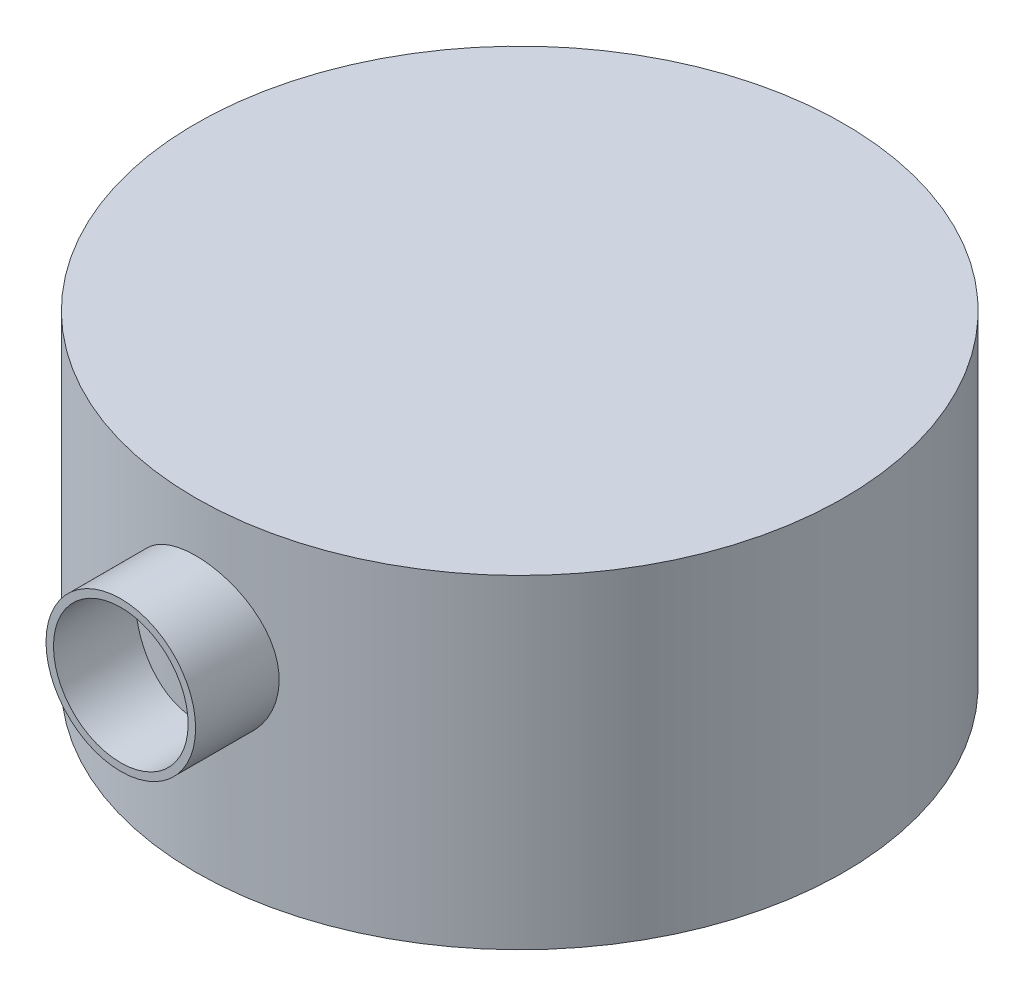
ISO-10303-21;
HEADER;
FILE_DESCRIPTION(('STEP AP214'),'2;1');
FILE_NAME('part.step','',(''),(''),'','','');
FILE_SCHEMA(('AUTOMOTIVE_DESIGN { 1 0 10303 214 1 1 1 1 }'));
ENDSEC;
DATA;
#1=APPLICATION_CONTEXT('core data for automotive mechanical design processes');
#2=APPLICATION_PROTOCOL_DEFINITION('international standard','automotive_design',2000,#1);
#3=PRODUCT_CONTEXT('',#1,'mechanical');
#4=PRODUCT('Part','Part','',(#3));
#5=PRODUCT_RELATED_PRODUCT_CATEGORY('part','',(#4));
#6=PRODUCT_DEFINITION_FORMATION('','',#4);
#7=PRODUCT_DEFINITION_CONTEXT('part definition',#1,'design');
#8=PRODUCT_DEFINITION('design','',#6,#7);
#9=PRODUCT_DEFINITION_SHAPE('','',#8);
#10=(LENGTH_UNIT() NAMED_UNIT(*) SI_UNIT(.MILLI.,.METRE.));
#11=(NAMED_UNIT(*) PLANE_ANGLE_UNIT() SI_UNIT($,.RADIAN.));
#12=(NAMED_UNIT(*) SI_UNIT($,.STERADIAN.) SOLID_ANGLE_UNIT());
#13=UNCERTAINTY_MEASURE_WITH_UNIT(LENGTH_MEASURE(1.E-05),#10,'distance_accuracy_value','');
#14=(GEOMETRIC_REPRESENTATION_CONTEXT(3) GLOBAL_UNCERTAINTY_ASSIGNED_CONTEXT((#13)) GLOBAL_UNIT_ASSIGNED_CONTEXT((#10,
#11,#12)) REPRESENTATION_CONTEXT('',''));
#15=CARTESIAN_POINT('',(0.,0.,0.));
#16=DIRECTION('',(0.,0.,1.));
#17=DIRECTION('',(1.,0.,0.));
#18=AXIS2_PLACEMENT_3D('',#15,#16,#17);
#19=CARTESIAN_POINT('',(0.,65.,0.));
#20=DIRECTION('',(0.,-1.,0.));
#21=DIRECTION('',(0.,0.,-1.));
#22=AXIS2_PLACEMENT_3D('',#19,#20,#21);
#23=CYLINDRICAL_SURFACE('',#22,65.);
#24=CARTESIAN_POINT('',(0.,65.,0.));
#25=DIRECTION('',(0.,1.,0.));
#26=DIRECTION('',(0.,0.,1.));
#27=AXIS2_PLACEMENT_3D('',#24,#25,#26);
#28=CIRCLE('',#27,65.);
#29=CARTESIAN_POINT('',(0.,65.,65.));
#30=VERTEX_POINT('',#29);
#31=EDGE_CURVE('E39',#30,#30,#28,.T.);
#32=ORIENTED_EDGE('',*,*,#31,.F.);
#33=EDGE_LOOP('',(#32));
#34=FACE_BOUND('',#33,.T.);
#35=CARTESIAN_POINT('',(0.,0.,0.));
#36=DIRECTION('',(0.,1.,0.));
#37=DIRECTION('',(0.,0.,1.));
#38=AXIS2_PLACEMENT_3D('',#35,#36,#37);
#39=CIRCLE('',#38,65.);
#40=CARTESIAN_POINT('',(0.,0.,65.));
#41=VERTEX_POINT('',#40);
#42=EDGE_CURVE('E43',#41,#41,#39,.T.);
#43=ORIENTED_EDGE('',*,*,#42,.T.);
#44=EDGE_LOOP('',(#43));
#45=FACE_BOUND('',#44,.T.);
#46=CARTESIAN_POINT('',(-15.,40.,63.2455532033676));
#47=CARTESIAN_POINT('',(-14.9999979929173,39.5847441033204,63.2455543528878));
#48=CARTESIAN_POINT('',(-14.9827415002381,39.169446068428,63.2496540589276));
#49=CARTESIAN_POINT('',(-14.9138518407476,38.3418380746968,63.2659327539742));
#50=CARTESIAN_POINT('',(-14.8622139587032,37.9295285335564,63.2781128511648));
#51=CARTESIAN_POINT('',(-14.724948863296,37.1106533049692,63.3101954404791));
#52=CARTESIAN_POINT('',(-14.6393011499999,36.704091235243,63.3301025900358));
#53=CARTESIAN_POINT('',(-14.4347188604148,35.8998719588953,63.3770454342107));
#54=CARTESIAN_POINT('',(-14.3157853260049,35.5022144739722,63.4040809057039));
#55=CARTESIAN_POINT('',(-14.0457301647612,34.7190105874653,63.4644512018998));
#56=CARTESIAN_POINT('',(-13.8946466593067,34.333450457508,63.497778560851));
#57=CARTESIAN_POINT('',(-13.5613532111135,33.5765507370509,63.5697942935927));
#58=CARTESIAN_POINT('',(-13.3791430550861,33.2052112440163,63.6084827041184));
#59=CARTESIAN_POINT('',(-12.9849272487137,32.4792099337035,63.6901260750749));
#60=CARTESIAN_POINT('',(-12.7729224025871,32.1245476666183,63.733080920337));
#61=CARTESIAN_POINT('',(-12.3205919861,31.4341769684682,63.8220661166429));
#62=CARTESIAN_POINT('',(-12.0802660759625,31.0984687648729,63.8680965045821));
#63=CARTESIAN_POINT('',(-11.5686191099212,30.4426505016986,63.9627692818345));
#64=CARTESIAN_POINT('',(-11.2968428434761,30.1228999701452,64.0114426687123));
#65=CARTESIAN_POINT('',(-10.7275109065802,29.5073223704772,64.1093122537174));
#66=CARTESIAN_POINT('',(-10.4299549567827,29.2114955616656,64.1585084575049));
#67=CARTESIAN_POINT('',(-9.81101299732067,28.6457129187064,64.25606710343));
#68=CARTESIAN_POINT('',(-9.48962506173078,28.3757591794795,64.3044294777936));
#69=CARTESIAN_POINT('',(-8.82515824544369,27.8635861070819,64.3989842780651));
#70=CARTESIAN_POINT('',(-8.4820792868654,27.6213668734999,64.4451766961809));
#71=CARTESIAN_POINT('',(-7.77233120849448,27.1636739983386,64.5346440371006));
#72=CARTESIAN_POINT('',(-7.40543141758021,26.9485498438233,64.577878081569));
#73=CARTESIAN_POINT('',(-6.6542672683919,26.5500374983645,64.659596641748));
#74=CARTESIAN_POINT('',(-6.27000273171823,26.3666496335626,64.698081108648));
#75=CARTESIAN_POINT('',(-5.48684724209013,26.0330518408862,64.7691984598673));
#76=CARTESIAN_POINT('',(-5.08795770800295,25.882838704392,64.8018319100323));
#77=CARTESIAN_POINT('',(-4.27839196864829,25.616784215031,64.860311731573));
#78=CARTESIAN_POINT('',(-3.86771599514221,25.5009421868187,64.8861582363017));
#79=CARTESIAN_POINT('',(-3.04481837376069,25.3063031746,64.9299305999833));
#80=CARTESIAN_POINT('',(-2.63274755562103,25.2268975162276,64.9479862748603));
#81=CARTESIAN_POINT('',(-1.80313867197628,25.1028663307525,64.9763105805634));
#82=CARTESIAN_POINT('',(-1.3856006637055,25.0582404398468,64.9865792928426));
#83=CARTESIAN_POINT('',(-0.548179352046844,25.0041495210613,64.9990371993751));
#84=CARTESIAN_POINT('',(-0.128296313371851,24.9946806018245,65.0012272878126));
#85=CARTESIAN_POINT('',(0.710746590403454,25.0109740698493,64.9974679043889));
#86=CARTESIAN_POINT('',(1.12990646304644,25.0367360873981,64.9915185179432));
#87=CARTESIAN_POINT('',(1.95648452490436,25.1224486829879,64.9718388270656));
#88=CARTESIAN_POINT('',(2.36397466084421,25.1817418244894,64.9582581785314));
#89=CARTESIAN_POINT('',(3.17239917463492,25.3335406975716,64.9237981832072));
#90=CARTESIAN_POINT('',(3.57333364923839,25.4260459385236,64.9029189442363));
#91=CARTESIAN_POINT('',(4.36588341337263,25.6435404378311,64.8544270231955));
#92=CARTESIAN_POINT('',(4.75749841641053,25.7685306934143,64.826814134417));
#93=CARTESIAN_POINT('',(5.52874476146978,26.0500356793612,64.765597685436));
#94=CARTESIAN_POINT('',(5.90837595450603,26.2065508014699,64.73199405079));
#95=CARTESIAN_POINT('',(6.65610440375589,26.5513155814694,64.6594038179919));
#96=CARTESIAN_POINT('',(7.02408572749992,26.7398080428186,64.6203764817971));
#97=CARTESIAN_POINT('',(7.74289461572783,27.1462820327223,64.5381938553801));
#98=CARTESIAN_POINT('',(8.0937221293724,27.3642636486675,64.4950385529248));
#99=CARTESIAN_POINT('',(8.77600332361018,27.8282301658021,64.4057464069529));
#100=CARTESIAN_POINT('',(9.10745456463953,28.0742185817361,64.3596091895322));
#101=CARTESIAN_POINT('',(9.74882371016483,28.592526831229,64.2655857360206));
#102=CARTESIAN_POINT('',(10.0587412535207,28.8648471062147,64.2176994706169));
#103=CARTESIAN_POINT('',(10.6619721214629,29.4406345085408,64.1203388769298));
#104=CARTESIAN_POINT('',(10.9547350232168,29.7446767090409,64.0708534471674));
#105=CARTESIAN_POINT('',(11.5136763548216,30.3764276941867,63.9727738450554));
#106=CARTESIAN_POINT('',(11.7798543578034,30.7041368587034,63.9241796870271));
#107=CARTESIAN_POINT('',(12.2838005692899,31.3810505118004,63.8292567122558));
#108=CARTESIAN_POINT('',(12.521567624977,31.7302558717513,63.7829279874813));
#109=CARTESIAN_POINT('',(12.9669869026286,32.447810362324,63.6938682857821));
#110=CARTESIAN_POINT('',(13.174639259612,32.8161594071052,63.6511372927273));
#111=CARTESIAN_POINT('',(13.5589932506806,33.5708726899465,63.5703738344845));
#112=CARTESIAN_POINT('',(13.7355795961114,33.9572975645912,63.5323590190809));
#113=CARTESIAN_POINT('',(14.0555000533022,34.7442117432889,63.4623491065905));
#114=CARTESIAN_POINT('',(14.1988339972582,35.1447011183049,63.4303540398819));
#115=CARTESIAN_POINT('',(14.4510673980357,35.9568074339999,63.3733649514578));
#116=CARTESIAN_POINT('',(14.5599718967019,36.3684227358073,63.3483699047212));
#117=CARTESIAN_POINT('',(14.7424555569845,37.1998010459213,63.306151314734));
#118=CARTESIAN_POINT('',(14.8160354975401,37.619563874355,63.2889276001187));
#119=CARTESIAN_POINT('',(14.9259758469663,38.4545153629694,63.2630884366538));
#120=CARTESIAN_POINT('',(14.9631411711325,38.869592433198,63.254286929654));
#121=CARTESIAN_POINT('',(15.0028094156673,39.7014899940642,63.2448901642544));
#122=CARTESIAN_POINT('',(15.0053128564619,40.1183104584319,63.2442947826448));
#123=CARTESIAN_POINT('',(14.9756377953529,40.9506133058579,63.2513280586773));
#124=CARTESIAN_POINT('',(14.9434617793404,41.3660957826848,63.2589561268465));
#125=CARTESIAN_POINT('',(14.8447038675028,42.1927224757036,63.2822039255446));
#126=CARTESIAN_POINT('',(14.7781220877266,42.6038667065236,63.2978236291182));
#127=CARTESIAN_POINT('',(14.6122354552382,43.4133514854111,63.3363221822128));
#128=CARTESIAN_POINT('',(14.513384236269,43.8117899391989,63.3591002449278));
#129=CARTESIAN_POINT('',(14.2835186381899,44.5988215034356,63.4113158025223));
#130=CARTESIAN_POINT('',(14.1525046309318,44.9874147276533,63.4407532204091));
#131=CARTESIAN_POINT('',(13.8592973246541,45.752182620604,63.5054517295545));
#132=CARTESIAN_POINT('',(13.6971015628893,46.1283563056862,63.5407132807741));
#133=CARTESIAN_POINT('',(13.3427204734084,46.8657971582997,63.6160719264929));
#134=CARTESIAN_POINT('',(13.1505346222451,47.2270640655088,63.6561691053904));
#135=CARTESIAN_POINT('',(12.734010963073,47.938368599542,63.7408101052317));
#136=CARTESIAN_POINT('',(12.5091826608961,48.2881114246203,63.7854178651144));
#137=CARTESIAN_POINT('',(12.0314669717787,48.967511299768,63.8772490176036));
#138=CARTESIAN_POINT('',(11.7785793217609,49.2971681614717,63.9244724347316));
#139=CARTESIAN_POINT('',(11.2464143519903,49.9343077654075,64.0202408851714));
#140=CARTESIAN_POINT('',(10.967133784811,50.241787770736,64.0687860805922));
#141=CARTESIAN_POINT('',(10.3840432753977,50.8325387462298,64.165870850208));
#142=CARTESIAN_POINT('',(10.0802331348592,51.1158095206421,64.2144104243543));
#143=CARTESIAN_POINT('',(9.44342756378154,51.6619592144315,64.3111773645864));
#144=CARTESIAN_POINT('',(9.10995328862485,51.9242851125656,64.3593767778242));
#145=CARTESIAN_POINT('',(8.42172481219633,52.4199187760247,64.453046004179));
#146=CARTESIAN_POINT('',(8.06697027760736,52.6532260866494,64.4985157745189));
#147=CARTESIAN_POINT('',(7.33860414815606,53.0891179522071,64.5854424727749));
#148=CARTESIAN_POINT('',(6.96499313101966,53.2917034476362,64.6268995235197));
#149=CARTESIAN_POINT('',(6.20148980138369,53.6646265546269,64.7046269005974));
#150=CARTESIAN_POINT('',(5.81159770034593,53.8349645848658,64.7408972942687));
#151=CARTESIAN_POINT('',(5.02099250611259,54.1410072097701,64.8069895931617));
#152=CARTESIAN_POINT('',(4.62037132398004,54.2769400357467,64.8368537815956));
#153=CARTESIAN_POINT('',(3.80864847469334,54.5145799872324,64.8895954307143));
#154=CARTESIAN_POINT('',(3.39754683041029,54.6162871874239,64.9124729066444));
#155=CARTESIAN_POINT('',(2.56792830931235,54.7846159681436,64.9505822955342));
#156=CARTESIAN_POINT('',(2.14941244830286,54.8512423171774,64.9658152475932));
#157=CARTESIAN_POINT('',(1.3080330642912,54.9488595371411,64.9881999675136));
#158=CARTESIAN_POINT('',(0.885169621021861,54.9798510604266,64.9953518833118));
#159=CARTESIAN_POINT('',(0.0480790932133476,55.0056311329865,65.0012986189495));
#160=CARTESIAN_POINT('',(-0.366121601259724,55.0012402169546,65.0002828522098));
#161=CARTESIAN_POINT('',(-1.19264255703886,54.9582366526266,64.9903716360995));
#162=CARTESIAN_POINT('',(-1.60496284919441,54.9196245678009,64.9814763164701));
#163=CARTESIAN_POINT('',(-2.42475582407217,54.8084996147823,64.956052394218));
#164=CARTESIAN_POINT('',(-2.83222863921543,54.7359876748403,64.9395240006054));
#165=CARTESIAN_POINT('',(-3.63945460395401,54.557651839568,64.8992888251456));
#166=CARTESIAN_POINT('',(-4.03920772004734,54.4518277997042,64.8755820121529));
#167=CARTESIAN_POINT('',(-4.8266396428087,54.2081923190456,64.8217454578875));
#168=CARTESIAN_POINT('',(-5.21436022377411,54.070510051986,64.7916416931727));
#169=CARTESIAN_POINT('',(-5.97677068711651,53.7639755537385,64.7257648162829));
#170=CARTESIAN_POINT('',(-6.35146063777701,53.595123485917,64.6899917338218));
#171=CARTESIAN_POINT('',(-7.0853775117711,53.2274673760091,64.6137258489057));
#172=CARTESIAN_POINT('',(-7.4446031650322,53.0286608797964,64.5732326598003));
#173=CARTESIAN_POINT('',(-8.14525053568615,52.6025010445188,64.4885992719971));
#174=CARTESIAN_POINT('',(-8.48667194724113,52.3751472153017,64.4444590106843));
#175=CARTESIAN_POINT('',(-9.15646889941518,51.888398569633,64.352744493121));
#176=CARTESIAN_POINT('',(-9.48442328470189,51.6284339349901,64.3051177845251));
#177=CARTESIAN_POINT('',(-10.1173720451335,51.0821279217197,64.2085765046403));
#178=CARTESIAN_POINT('',(-10.4223660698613,50.7957861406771,64.1596619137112));
#179=CARTESIAN_POINT('',(-11.0074581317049,50.1985615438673,64.0618754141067));
#180=CARTESIAN_POINT('',(-11.2875501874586,49.8876728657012,64.0130035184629));
#181=CARTESIAN_POINT('',(-11.8208856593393,49.2434586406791,63.9166654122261));
#182=CARTESIAN_POINT('',(-12.0741291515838,48.9101331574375,63.8691991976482));
#183=CARTESIAN_POINT('',(-12.5556970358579,48.217963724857,63.7762929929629));
#184=CARTESIAN_POINT('',(-12.783580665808,47.8588072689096,63.7308951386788));
#185=CARTESIAN_POINT('',(-13.2082187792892,47.1220592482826,63.6442451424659));
#186=CARTESIAN_POINT('',(-13.4049733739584,46.7444677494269,63.6029929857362));
#187=CARTESIAN_POINT('',(-13.7657299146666,45.9737429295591,63.5258899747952));
#188=CARTESIAN_POINT('',(-13.9297545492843,45.5806206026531,63.4900353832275));
#189=CARTESIAN_POINT('',(-14.223900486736,44.781411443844,63.4247852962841));
#190=CARTESIAN_POINT('',(-14.3540275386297,44.3753268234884,63.3953887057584));
#191=CARTESIAN_POINT('',(-14.5549354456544,43.6421752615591,63.3495224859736));
#192=CARTESIAN_POINT('',(-14.6324651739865,43.3170276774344,63.3316320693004));
#193=CARTESIAN_POINT('',(-14.7656714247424,42.6620662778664,63.3007080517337));
#194=CARTESIAN_POINT('',(-14.8213495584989,42.3322528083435,63.2876740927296));
#195=CARTESIAN_POINT('',(-14.9105587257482,41.6694505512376,63.2667159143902));
#196=CARTESIAN_POINT('',(-14.9440876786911,41.3364614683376,63.2587921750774));
#197=CARTESIAN_POINT('',(-14.9888066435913,40.6689904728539,63.2482109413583));
#198=CARTESIAN_POINT('',(-15.0000016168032,40.3345089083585,63.2455522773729));
#199=CARTESIAN_POINT('',(-15.,40.,63.2455532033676));
#200=B_SPLINE_CURVE_WITH_KNOTS('',3,(#46,#47,#48,#49,#50,#51,#52,#53,#54,#55,#56,#57,#58,#59,
#60,#61,#62,#63,#64,#65,#66,#67,#68,#69,#70,#71,#72,#73,#74,#75,#76,#77,#78,#79,#80,#81,#82,#83,
#84,#85,#86,#87,#88,#89,#90,#91,#92,#93,#94,#95,#96,#97,#98,#99,#100,#101,#102,#103,#104,#105,
#106,#107,#108,#109,#110,#111,#112,#113,#114,#115,#116,#117,#118,#119,#120,#121,#122,#123,#124,
#125,#126,#127,#128,#129,#130,#131,#132,#133,#134,#135,#136,#137,#138,#139,#140,#141,#142,#143,
#144,#145,#146,#147,#148,#149,#150,#151,#152,#153,#154,#155,#156,#157,#158,#159,#160,#161,#162,
#163,#164,#165,#166,#167,#168,#169,#170,#171,#172,#173,#174,#175,#176,#177,#178,#179,#180,#181,
#182,#183,#184,#185,#186,#187,#188,#189,#190,#191,#192,#193,#194,#195,#196,#197,#198,#199),
.UNSPECIFIED.,.T.,.F.,(4,2,2,2,2,2,2,2,2,2,2,2,2,2,2,2,2,2,2,2,2,2,2,2,2,2,2,2,2,2,2,2,2,2,2,2,
2,2,2,2,2,2,2,2,2,2,2,2,2,2,2,2,2,2,2,2,2,2,2,2,2,2,2,2,2,2,2,2,2,2,2,2,2,2,2,2,4),(0.,
1.24546329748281,2.49109743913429,3.73748354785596,4.98383064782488,6.2287080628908,
7.47359400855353,8.71844635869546,9.96331364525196,11.2292209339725,12.49514194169,
13.7611653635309,15.0271933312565,16.3081667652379,17.5891533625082,18.8700160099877,
20.1508534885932,21.4094368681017,22.6680070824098,23.9264379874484,25.1848556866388,
26.4194152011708,27.6539564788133,28.8885356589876,30.1231301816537,31.3675568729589,
32.611987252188,33.8565739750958,35.1011815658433,36.3745995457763,37.6480379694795,
38.9215280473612,40.1950124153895,41.4731274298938,42.7512488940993,44.0291831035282,
45.3070891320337,46.5560641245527,47.8050203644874,49.0538870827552,50.3027495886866,
51.534761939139,52.7667600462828,53.9988554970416,55.2309724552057,56.4840090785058,
57.7370574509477,58.9902602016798,60.2434730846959,61.5229983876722,62.8025437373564,
64.0820499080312,65.3615394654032,66.6323047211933,67.9030672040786,69.1736569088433,
70.4442233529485,71.6854110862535,72.9265783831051,74.1677116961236,75.4088503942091,
76.6450422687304,77.8812276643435,79.1175143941,80.3538223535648,81.6159401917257,
82.8780772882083,84.1405167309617,85.4029525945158,86.6847121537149,87.9664671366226,
89.247330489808,90.52797646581,91.5314607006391,92.5348709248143,93.5383753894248,
94.541656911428),.UNSPECIFIED.);
#201=CARTESIAN_POINT('',(-15.,40.,63.2455532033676));
#202=VERTEX_POINT('',#201);
#203=EDGE_CURVE('E10',#202,#202,#200,.T.);
#204=ORIENTED_EDGE('',*,*,#203,.F.);
#205=EDGE_LOOP('',(#204));
#206=FACE_BOUND('',#205,.T.);
#207=ADVANCED_FACE('F28',(#34,#45,#206),#23,.T.);
#208=CARTESIAN_POINT('',(0.,65.,0.));
#209=DIRECTION('',(0.,1.,0.));
#210=DIRECTION('',(0.,0.,1.));
#211=AXIS2_PLACEMENT_3D('',#208,#209,#210);
#212=PLANE('',#211);
#213=ORIENTED_EDGE('',*,*,#31,.T.);
#214=EDGE_LOOP('',(#213));
#215=FACE_BOUND('',#214,.T.);
#216=ADVANCED_FACE('F71',(#215),#212,.T.);
#217=CARTESIAN_POINT('',(0.,0.,0.));
#218=DIRECTION('',(0.,1.,0.));
#219=DIRECTION('',(0.,0.,1.));
#220=AXIS2_PLACEMENT_3D('',#217,#218,#219);
#221=PLANE('',#220);
#222=ORIENTED_EDGE('',*,*,#42,.F.);
#223=EDGE_LOOP('',(#222));
#224=FACE_BOUND('',#223,.T.);
#225=ADVANCED_FACE('F68',(#224),#221,.F.);
#226=CARTESIAN_POINT('',(0.,40.,80.));
#227=DIRECTION('',(0.,0.,-1.));
#228=DIRECTION('',(-1.,0.,0.));
#229=AXIS2_PLACEMENT_3D('',#226,#227,#228);
#230=CYLINDRICAL_SURFACE('',#229,15.);
#231=CARTESIAN_POINT('',(0.,40.,80.));
#232=DIRECTION('',(0.,0.,1.));
#233=DIRECTION('',(1.,0.,0.));
#234=AXIS2_PLACEMENT_3D('',#231,#232,#233);
#235=CIRCLE('',#234,15.);
#236=CARTESIAN_POINT('',(15.,40.,80.));
#237=VERTEX_POINT('',#236);
#238=EDGE_CURVE('E55',#237,#237,#235,.T.);
#239=ORIENTED_EDGE('',*,*,#238,.F.);
#240=EDGE_LOOP('',(#239));
#241=FACE_BOUND('',#240,.T.);
#242=ORIENTED_EDGE('',*,*,#203,.T.);
#243=EDGE_LOOP('',(#242));
#244=FACE_BOUND('',#243,.T.);
#245=ADVANCED_FACE('F61',(#241,#244),#230,.T.);
#246=CARTESIAN_POINT('',(0.,40.,80.));
#247=DIRECTION('',(0.,0.,-1.));
#248=DIRECTION('',(-1.,0.,0.));
#249=AXIS2_PLACEMENT_3D('',#246,#247,#248);
#250=CYLINDRICAL_SURFACE('',#249,13.5);
#251=CARTESIAN_POINT('',(0.,40.,80.));
#252=DIRECTION('',(0.,0.,1.));
#253=DIRECTION('',(1.,0.,0.));
#254=AXIS2_PLACEMENT_3D('',#251,#252,#253);
#255=CIRCLE('',#254,13.5);
#256=CARTESIAN_POINT('',(13.5,40.,80.));
#257=VERTEX_POINT('',#256);
#258=EDGE_CURVE('E127',#257,#257,#255,.T.);
#259=ORIENTED_EDGE('',*,*,#258,.T.);
#260=EDGE_LOOP('',(#259));
#261=FACE_BOUND('',#260,.T.);
#262=CARTESIAN_POINT('',(-13.5,40.,63.5826234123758));
#263=CARTESIAN_POINT('',(-13.5000079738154,39.6251380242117,63.582618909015));
#264=CARTESIAN_POINT('',(-13.4843826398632,39.2503736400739,63.5859445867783));
#265=CARTESIAN_POINT('',(-13.4220232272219,38.503446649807,63.5991383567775));
#266=CARTESIAN_POINT('',(-13.3752841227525,38.131284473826,63.6090075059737));
#267=CARTESIAN_POINT('',(-13.2510183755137,37.392107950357,63.6350100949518));
#268=CARTESIAN_POINT('',(-13.173470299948,37.025097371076,63.6511478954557));
#269=CARTESIAN_POINT('',(-12.9882106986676,36.2990920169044,63.6892088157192));
#270=CARTESIAN_POINT('',(-12.8805003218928,35.9400969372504,63.7111317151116));
#271=CARTESIAN_POINT('',(-12.6358767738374,35.2329840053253,63.7600983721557));
#272=CARTESIAN_POINT('',(-12.4989940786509,34.8848552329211,63.7871367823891));
#273=CARTESIAN_POINT('',(-12.1969843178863,34.2014537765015,63.845573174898));
#274=CARTESIAN_POINT('',(-12.0318570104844,33.8661812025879,63.876971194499));
#275=CARTESIAN_POINT('',(-11.6745670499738,33.2107596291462,63.9432363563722));
#276=CARTESIAN_POINT('',(-11.4824063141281,32.89060955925,63.9781032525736));
#277=CARTESIAN_POINT('',(-11.0723840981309,32.267509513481,64.050336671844));
#278=CARTESIAN_POINT('',(-10.8545222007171,31.9645598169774,64.0877032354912));
#279=CARTESIAN_POINT('',(-10.3914303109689,31.3738217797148,64.1644293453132));
#280=CARTESIAN_POINT('',(-10.1458666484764,31.0862975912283,64.2038091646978));
#281=CARTESIAN_POINT('',(-9.631527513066,30.5328787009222,64.2829787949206));
#282=CARTESIAN_POINT('',(-9.36275183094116,30.2669841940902,64.3227686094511));
#283=CARTESIAN_POINT('',(-8.80377636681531,29.7586008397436,64.4016550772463));
#284=CARTESIAN_POINT('',(-8.5135750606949,29.5161136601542,64.4407516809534));
#285=CARTESIAN_POINT('',(-7.91370647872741,29.056230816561,64.5171655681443));
#286=CARTESIAN_POINT('',(-7.60403914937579,28.8388352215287,64.554482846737));
#287=CARTESIAN_POINT('',(-6.96430258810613,28.4287335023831,64.626643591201));
#288=CARTESIAN_POINT('',(-6.63406809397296,28.2362803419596,64.6614603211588));
#289=CARTESIAN_POINT('',(-5.95816366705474,27.879923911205,64.7272397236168));
#290=CARTESIAN_POINT('',(-5.61249360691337,27.716020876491,64.7582023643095));
#291=CARTESIAN_POINT('',(-4.90818110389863,27.418030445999,64.8153883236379));
#292=CARTESIAN_POINT('',(-4.54953967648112,27.2839407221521,64.8416120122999));
#293=CARTESIAN_POINT('',(-3.82183802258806,27.0466215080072,64.8885696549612));
#294=CARTESIAN_POINT('',(-3.45277796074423,26.9433915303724,64.9093036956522));
#295=CARTESIAN_POINT('',(-2.71222995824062,26.7698683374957,64.9444321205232));
#296=CARTESIAN_POINT('',(-2.34085060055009,26.6991289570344,64.9589122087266));
#297=CARTESIAN_POINT('',(-1.5932781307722,26.5890266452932,64.9815458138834));
#298=CARTESIAN_POINT('',(-1.21708505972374,26.5496634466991,64.9896993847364));
#299=CARTESIAN_POINT('',(-0.462672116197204,26.5026387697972,64.9994479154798));
#300=CARTESIAN_POINT('',(-0.0844524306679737,26.4949744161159,65.0010434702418));
#301=CARTESIAN_POINT('',(0.671264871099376,26.5114031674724,64.9976321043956));
#302=CARTESIAN_POINT('',(1.04876249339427,26.535496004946,64.9926252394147));
#303=CARTESIAN_POINT('',(1.79448189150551,26.614625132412,64.9762787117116));
#304=CARTESIAN_POINT('',(2.16275704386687,26.6691799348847,64.9650376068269));
#305=CARTESIAN_POINT('',(2.89331977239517,26.808450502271,64.9366024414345));
#306=CARTESIAN_POINT('',(3.25560742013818,26.8931659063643,64.9194084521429));
#307=CARTESIAN_POINT('',(3.9716862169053,27.092103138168,64.879536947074));
#308=CARTESIAN_POINT('',(4.32547713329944,27.2063257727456,64.856859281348));
#309=CARTESIAN_POINT('',(5.0221369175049,27.4634134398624,64.8066363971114));
#310=CARTESIAN_POINT('',(5.36500567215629,27.6062787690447,64.7790911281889));
#311=CARTESIAN_POINT('',(6.03977538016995,27.9206549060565,64.7196771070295));
#312=CARTESIAN_POINT('',(6.37158739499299,28.0923513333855,64.6877806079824));
#313=CARTESIAN_POINT('',(7.01959621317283,28.462474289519,64.6206731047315));
#314=CARTESIAN_POINT('',(7.33579297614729,28.6609008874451,64.5854620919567));
#315=CARTESIAN_POINT('',(7.95052589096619,29.0831233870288,64.5126728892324));
#316=CARTESIAN_POINT('',(8.24906020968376,29.3069219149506,64.4750944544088));
#317=CARTESIAN_POINT('',(8.82648983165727,29.7783562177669,64.3985862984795));
#318=CARTESIAN_POINT('',(9.10538487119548,30.0259923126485,64.3596565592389));
#319=CARTESIAN_POINT('',(9.64676283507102,30.5483286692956,64.2807608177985));
#320=CARTESIAN_POINT('',(9.90883862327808,30.8234502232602,64.2407890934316));
#321=CARTESIAN_POINT('',(10.4089312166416,31.3948673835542,64.1616572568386));
#322=CARTESIAN_POINT('',(10.6469477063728,31.6911632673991,64.1224971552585));
#323=CARTESIAN_POINT('',(11.0972731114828,32.3029359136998,64.0460983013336));
#324=CARTESIAN_POINT('',(11.3095813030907,32.6184132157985,64.0088596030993));
#325=CARTESIAN_POINT('',(11.7069670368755,33.2663998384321,63.9373732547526));
#326=CARTESIAN_POINT('',(11.8920446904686,33.5989090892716,63.9031255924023));
#327=CARTESIAN_POINT('',(12.2340312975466,34.2795209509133,63.8385373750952));
#328=CARTESIAN_POINT('',(12.3908693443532,34.6276601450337,63.8082067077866));
#329=CARTESIAN_POINT('',(12.6746100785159,35.3363176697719,63.7524523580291));
#330=CARTESIAN_POINT('',(12.801512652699,35.6968360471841,63.7270286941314));
#331=CARTESIAN_POINT('',(13.0243625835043,36.4276215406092,63.6818570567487));
#332=CARTESIAN_POINT('',(13.1203135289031,36.7978875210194,63.6621084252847));
#333=CARTESIAN_POINT('',(13.2804946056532,37.5454942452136,63.6288862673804));
#334=CARTESIAN_POINT('',(13.3447252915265,37.9228348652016,63.6154126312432));
#335=CARTESIAN_POINT('',(13.4400436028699,38.6747829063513,63.5953422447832));
#336=CARTESIAN_POINT('',(13.4717203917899,39.0493124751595,63.5886232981));
#337=CARTESIAN_POINT('',(13.5037384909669,39.7997669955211,63.581831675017));
#338=CARTESIAN_POINT('',(13.5040801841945,40.1756919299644,63.581758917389));
#339=CARTESIAN_POINT('',(13.4734266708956,40.9261809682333,63.5882616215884));
#340=CARTESIAN_POINT('',(13.4424332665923,41.3007451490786,63.5948367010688));
#341=CARTESIAN_POINT('',(13.3493659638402,42.0458193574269,63.6144377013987));
#342=CARTESIAN_POINT('',(13.2872921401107,42.4163293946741,63.62746360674));
#343=CARTESIAN_POINT('',(13.1333788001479,43.1467778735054,63.659409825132));
#344=CARTESIAN_POINT('',(13.0418586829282,43.5067864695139,63.6782668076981));
#345=CARTESIAN_POINT('',(12.8295863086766,44.217741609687,63.7213734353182));
#346=CARTESIAN_POINT('',(12.7088343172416,44.5686882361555,63.7456230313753));
#347=CARTESIAN_POINT('',(12.4389939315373,45.2591667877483,63.7988270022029));
#348=CARTESIAN_POINT('',(12.2899036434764,45.5986979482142,63.8277816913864));
#349=CARTESIAN_POINT('',(11.9644720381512,46.2640698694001,63.8895830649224));
#350=CARTESIAN_POINT('',(11.788130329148,46.5899104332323,63.9224298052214));
#351=CARTESIAN_POINT('',(11.406782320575,47.2302217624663,63.9915883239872));
#352=CARTESIAN_POINT('',(11.2014096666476,47.5444698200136,64.0279421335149));
#353=CARTESIAN_POINT('',(10.765350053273,48.1546214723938,64.1027000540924));
#354=CARTESIAN_POINT('',(10.534662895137,48.4505249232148,64.1411041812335));
#355=CARTESIAN_POINT('',(10.0495178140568,49.0220680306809,64.2189032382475));
#356=CARTESIAN_POINT('',(9.79505753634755,49.2977056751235,64.2582982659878));
#357=CARTESIAN_POINT('',(9.26408184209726,49.8268650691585,64.3369940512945));
#358=CARTESIAN_POINT('',(8.98756629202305,50.0803866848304,64.3762948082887));
#359=CARTESIAN_POINT('',(8.40951639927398,50.5676532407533,64.4543752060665));
#360=CARTESIAN_POINT('',(8.10764162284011,50.8009976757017,64.493135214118));
#361=CARTESIAN_POINT('',(7.48503152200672,51.2414283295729,64.5683561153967));
#362=CARTESIAN_POINT('',(7.16429596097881,51.4485142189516,64.6048169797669));
#363=CARTESIAN_POINT('',(6.50617621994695,51.8349174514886,64.6744086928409));
#364=CARTESIAN_POINT('',(6.16879251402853,52.0142355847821,64.7075396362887));
#365=CARTESIAN_POINT('',(5.47971969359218,52.3437644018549,64.7695323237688));
#366=CARTESIAN_POINT('',(5.12803073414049,52.4939754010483,64.7983941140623));
#367=CARTESIAN_POINT('',(4.41500031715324,52.7633119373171,64.850865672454));
#368=CARTESIAN_POINT('',(4.05372995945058,52.8826196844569,64.8745060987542));
#369=CARTESIAN_POINT('',(3.32210049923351,53.090387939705,64.9160834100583));
#370=CARTESIAN_POINT('',(2.95174141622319,53.1788485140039,64.9340203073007));
#371=CARTESIAN_POINT('',(2.20467313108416,53.3241963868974,64.9636755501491));
#372=CARTESIAN_POINT('',(1.82796462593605,53.3810871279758,64.9753945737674));
#373=CARTESIAN_POINT('',(1.07094381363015,53.4628382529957,64.9922795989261));
#374=CARTESIAN_POINT('',(0.690631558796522,53.4876991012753,64.9974456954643));
#375=CARTESIAN_POINT('',(-0.0636111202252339,53.5050202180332,65.0010423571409));
#376=CARTESIAN_POINT('',(-0.437527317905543,53.4980799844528,64.9995975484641));
#377=CARTESIAN_POINT('',(-1.18341238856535,53.4532196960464,64.990296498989));
#378=CARTESIAN_POINT('',(-1.55538128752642,53.4153000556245,64.9824403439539));
#379=CARTESIAN_POINT('',(-2.29470587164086,53.3087869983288,64.9605349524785));
#380=CARTESIAN_POINT('',(-2.66206164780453,53.2401941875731,64.9464858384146));
#381=CARTESIAN_POINT('',(-3.3895711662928,53.0728774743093,64.9125829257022));
#382=CARTESIAN_POINT('',(-3.74972487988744,52.9741534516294,64.8927291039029));
#383=CARTESIAN_POINT('',(-4.4593770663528,52.7476397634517,64.8478221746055));
#384=CARTESIAN_POINT('',(-4.80890128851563,52.6199279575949,64.8227830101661));
#385=CARTESIAN_POINT('',(-5.49591443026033,52.3362490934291,64.7681532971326));
#386=CARTESIAN_POINT('',(-5.83340339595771,52.1802821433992,64.7385627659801));
#387=CARTESIAN_POINT('',(-6.49412014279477,51.8412116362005,64.6756256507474));
#388=CARTESIAN_POINT('',(-6.81734700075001,51.6581063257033,64.6422788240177));
#389=CARTESIAN_POINT('',(-7.4474020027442,51.2660498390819,64.5727239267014));
#390=CARTESIAN_POINT('',(-7.75422991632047,51.0570982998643,64.5365158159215));
#391=CARTESIAN_POINT('',(-8.35464924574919,50.6109439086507,64.4615618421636));
#392=CARTESIAN_POINT('',(-8.64792004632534,50.3733150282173,64.4227829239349));
#393=CARTESIAN_POINT('',(-9.21348045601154,49.8744100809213,64.344333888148));
#394=CARTESIAN_POINT('',(-9.48576978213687,49.6131336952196,64.3046637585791));
#395=CARTESIAN_POINT('',(-10.0076059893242,49.0686301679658,64.2255206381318));
#396=CARTESIAN_POINT('',(-10.2571474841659,48.7853978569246,64.1860476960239));
#397=CARTESIAN_POINT('',(-10.731721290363,48.1989298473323,64.1084080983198));
#398=CARTESIAN_POINT('',(-10.9567537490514,47.895694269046,64.070241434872));
#399=CARTESIAN_POINT('',(-11.3832628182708,47.267540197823,63.9958495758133));
#400=CARTESIAN_POINT('',(-11.584429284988,46.9424076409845,63.9596526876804));
#401=CARTESIAN_POINT('',(-11.9586038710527,46.2759731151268,63.8907504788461));
#402=CARTESIAN_POINT('',(-12.131612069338,45.9346711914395,63.8580451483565));
#403=CARTESIAN_POINT('',(-12.4480443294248,45.2385329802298,63.7971172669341));
#404=CARTESIAN_POINT('',(-12.5914911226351,44.8837073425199,63.7688912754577));
#405=CARTESIAN_POINT('',(-12.8478145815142,44.1629343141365,63.7177422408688));
#406=CARTESIAN_POINT('',(-12.9606969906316,43.7969890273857,63.6948182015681));
#407=CARTESIAN_POINT('',(-13.2042630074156,42.8687640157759,63.6448759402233));
#408=CARTESIAN_POINT('',(-13.3150068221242,42.3009158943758,63.6216644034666));
#409=CARTESIAN_POINT('',(-13.4628677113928,41.1553010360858,63.5905419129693));
#410=CARTESIAN_POINT('',(-13.4999877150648,40.5775346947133,63.5826303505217));
#411=CARTESIAN_POINT('',(-13.5,40.,63.5826234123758));
#412=B_SPLINE_CURVE_WITH_KNOTS('',3,(#262,#263,#264,#265,#266,#267,#268,#269,#270,#271,#272,
#273,#274,#275,#276,#277,#278,#279,#280,#281,#282,#283,#284,#285,#286,#287,#288,#289,#290,#291,
#292,#293,#294,#295,#296,#297,#298,#299,#300,#301,#302,#303,#304,#305,#306,#307,#308,#309,#310,
#311,#312,#313,#314,#315,#316,#317,#318,#319,#320,#321,#322,#323,#324,#325,#326,#327,#328,#329,
#330,#331,#332,#333,#334,#335,#336,#337,#338,#339,#340,#341,#342,#343,#344,#345,#346,#347,#348,
#349,#350,#351,#352,#353,#354,#355,#356,#357,#358,#359,#360,#361,#362,#363,#364,#365,#366,#367,
#368,#369,#370,#371,#372,#373,#374,#375,#376,#377,#378,#379,#380,#381,#382,#383,#384,#385,#386,
#387,#388,#389,#390,#391,#392,#393,#394,#395,#396,#397,#398,#399,#400,#401,#402,#403,#404,#405,
#406,#407,#408,#409,#410,#411),.UNSPECIFIED.,.T.,.F.,(4,2,2,2,2,2,2,2,2,2,2,2,2,2,2,2,2,2,2,2,2,
2,2,2,2,2,2,2,2,2,2,2,2,2,2,2,2,2,2,2,2,2,2,2,2,2,2,2,2,2,2,2,2,2,2,2,2,2,2,2,2,2,2,2,2,2,2,2,2,
2,2,2,2,2,4),(0.,1.12407791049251,2.24833743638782,3.37338044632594,4.49838060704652,
5.62221120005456,6.74605141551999,7.86981196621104,8.9935907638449,10.1327452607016,
11.2719100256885,12.4111559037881,13.5504049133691,14.7004290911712,15.8504627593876,
17.0004065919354,18.1503322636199,19.2839566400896,20.4175713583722,21.551083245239,
22.6845855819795,23.8006590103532,24.9167190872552,26.0328096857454,27.1489118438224,
28.2724963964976,29.3960838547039,30.5197877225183,31.6435066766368,32.7883522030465,
33.9332127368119,35.0781054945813,36.222993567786,37.3707174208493,38.5184456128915,
39.6660406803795,40.8136156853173,41.9400351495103,43.066440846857,44.1927817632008,
45.3191199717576,46.4336310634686,47.5481320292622,48.6627075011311,49.777298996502,
50.9074765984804,52.0376630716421,53.1679616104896,54.298266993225,55.4474296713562,
56.5966067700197,57.7457511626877,58.8948831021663,60.0370768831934,61.17926821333,
62.321334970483,63.463385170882,64.5839955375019,65.7045909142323,66.8251641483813,
67.9457418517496,69.0633446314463,70.180943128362,71.2986138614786,72.4163002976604,
73.5533130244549,74.6903410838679,75.827637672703,76.964927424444,78.1156707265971,
79.2664108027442,80.416262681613,81.5658983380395,83.297788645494,85.0296100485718),.UNSPECIFIED.);
#413=CARTESIAN_POINT('',(-13.5,40.,63.5826234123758));
#414=VERTEX_POINT('',#413);
#415=EDGE_CURVE('E48',#414,#414,#412,.T.);
#416=ORIENTED_EDGE('',*,*,#415,.F.);
#417=EDGE_LOOP('',(#416));
#418=FACE_BOUND('',#417,.T.);
#419=ADVANCED_FACE('F56',(#261,#418),#250,.F.);
#420=CARTESIAN_POINT('',(0.,40.,80.));
#421=DIRECTION('',(0.,0.,1.));
#422=DIRECTION('',(1.,0.,0.));
#423=AXIS2_PLACEMENT_3D('',#420,#421,#422);
#424=PLANE('',#423);
#425=ORIENTED_EDGE('',*,*,#238,.T.);
#426=EDGE_LOOP('',(#425));
#427=FACE_BOUND('',#426,.T.);
#428=ORIENTED_EDGE('',*,*,#258,.F.);
#429=EDGE_LOOP('',(#428));
#430=FACE_BOUND('',#429,.T.);
#431=ADVANCED_FACE('F60',(#427,#430),#424,.T.);
#432=ORIENTED_EDGE('',*,*,#415,.T.);
#433=EDGE_LOOP('',(#432));
#434=FACE_BOUND('',#433,.T.);
#435=ADVANCED_FACE('F30',(#434),#23,.T.);
#436=CLOSED_SHELL('',(#207,#216,#225,#245,#419,#431,#435));
#437=MANIFOLD_SOLID_BREP('B2',#436);
#438=ADVANCED_BREP_SHAPE_REPRESENTATION('',(#18,#437),#14);
#439=SHAPE_DEFINITION_REPRESENTATION(#9,#438);
ENDSEC;
END-ISO-10303-21;
